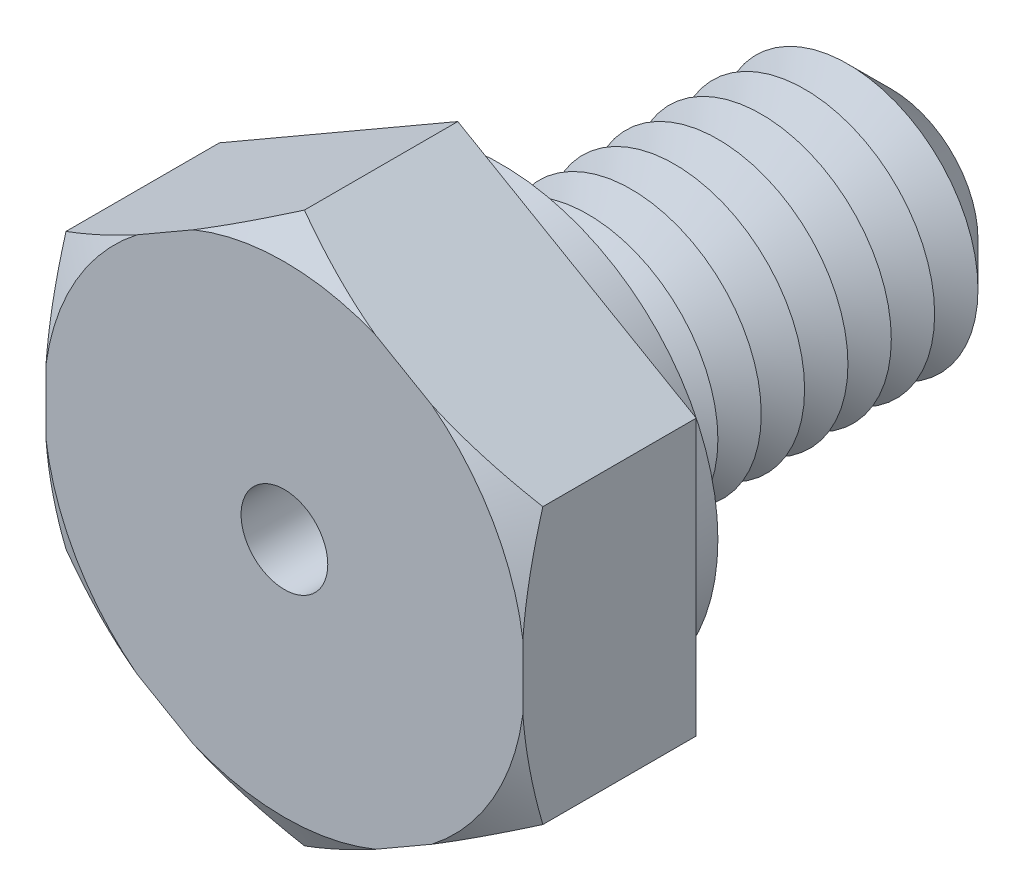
from build123d import *

# Parameters (mm, degrees)
BOSS_EXTRUDE1_DEPTH = 2
SKETCH3_R           = 1.5
BOSS_EXTRUDE2_DEPTH = 5
SKETCH4_R           = 2.5
BOSS_EXTRUDE3_DEPTH = 0.5
CHAMFER1_SIZE       = 0.5
LPATTERN1_COUNT     = 8
LPATTERN1_PITCH     = 0.5
SKETCH8_R           = 0.5
CUT_EXTRUDE1_DEPTH  = 7


with BuildPart() as part:
    # Sketch2 → Boss-Extrude1 (new body)
    with BuildSketch(Plane.XY):
        Polygon((0, 3.175426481), (-2.75, 1.58771324), (-2.75, -1.58771324), (0, -3.175426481), (2.75, -1.58771324), (2.75, 1.58771324), align=None)
    extrude(amount=BOSS_EXTRUDE1_DEPTH)

    # Sketch3 → Boss-Extrude2 (add)
    with BuildSketch(Plane(origin=(0, 0, 0), x_dir=(-1, 0, 0), z_dir=(0, 0, -1))):
        Circle(SKETCH3_R)
    extrude(amount=BOSS_EXTRUDE2_DEPTH)

    # Sketch4 → Boss-Extrude3 (add)
    with BuildSketch(Plane(origin=(0, 0, 0), x_dir=(-1, 0, 0), z_dir=(0, 0, -1))):
        with Locations(Location((0, 0, 0), (0, 0, 180))):
            Circle(SKETCH4_R)
    extrude(amount=BOSS_EXTRUDE3_DEPTH)

    # Chamfer1
    chamfer1_edges = [part.edges().sort_by_distance(p)[0] for p in [
        (1.5, 0, -5),
    ]]
    chamfer(chamfer1_edges, length=CHAMFER1_SIZE)

    # Sketch6 → Cut-Revolve1 (revolve, cut)
    with BuildSketch(Plane(origin=(0, 0, 0), x_dir=(0, 0, -1), z_dir=(1, 0, 0)), mode=Mode.PRIVATE) as cut_revolve1_sk:
        Polygon((0.5, 1.5), (0.75, 1.066987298), (1, 1.5), align=None)
    cut_revolve1 = revolve(cut_revolve1_sk.sketch.rotate(Axis((0, 0, 3.211670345), (0, 0, -1)), 90), axis=Axis((0, 0, 3.211670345), (0, 0, -1)), mode=Mode.SUBTRACT)

    # LPattern1: Cut-Revolve1 ×8
    with Locations(*[(0, 0, -i * LPATTERN1_PITCH) for i in range(1, LPATTERN1_COUNT)]):
        add(cut_revolve1, mode=Mode.SUBTRACT)

    # Sketch7 → Cut-Revolve2 (revolve, cut)
    with BuildSketch(Plane(origin=(0, 0, 0), x_dir=(0, 0, -1), z_dir=(1, 0, 0)), mode=Mode.PRIVATE) as cut_revolve2_sk:
        Polygon((-2, 3.175426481), (-2, 2.775426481), (-1.769059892, 3.175426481), align=None)
    revolve(cut_revolve2_sk.sketch.rotate(Axis((0, 0, 3.211670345), (0, 0, -1)), 90), axis=Axis((0, 0, 3.211670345), (0, 0, -1)), mode=Mode.SUBTRACT)

    # Sketch8 → Cut-Extrude1 (cut)
    with BuildSketch(Plane.XY.offset(2)):
        Circle(SKETCH8_R)
    extrude(amount=-CUT_EXTRUDE1_DEPTH, mode=Mode.SUBTRACT)


solid = part.part
